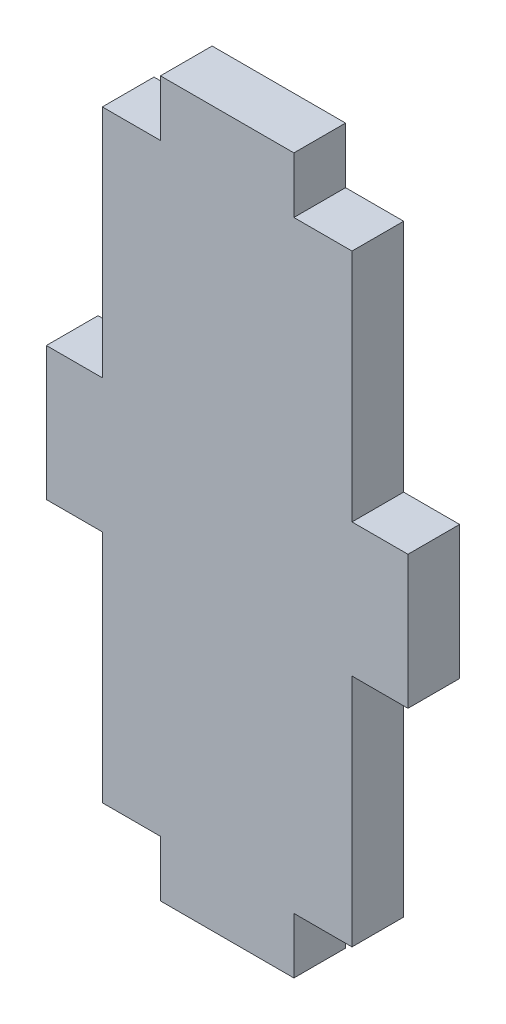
from build123d import *

# Parameters (mm, degrees)
BOSS_EXTRUDE1_DEPTH = 6


with BuildPart() as part:
    # Sketch1 → Boss-Extrude1 (new body)
    with BuildSketch(Plane.XY):
        Polygon((-14.5, -35), (-7.75, -35), (-7.75, -41.5), (7.75, -41.5), (7.75, -35), (14.5, -35), (14.5, -7.75), (21, -7.75), (21, 7.75), (14.5, 7.75), (14.5, 35), (7.75, 35), (7.75, 41.5), (-7.75, 41.5), (-7.75, 35), (-14.5, 35), (-14.5, 7.75), (-21, 7.75), (-21, -7.75), (-14.5, -7.75), align=None)
    extrude(amount=BOSS_EXTRUDE1_DEPTH)


solid = part.part
